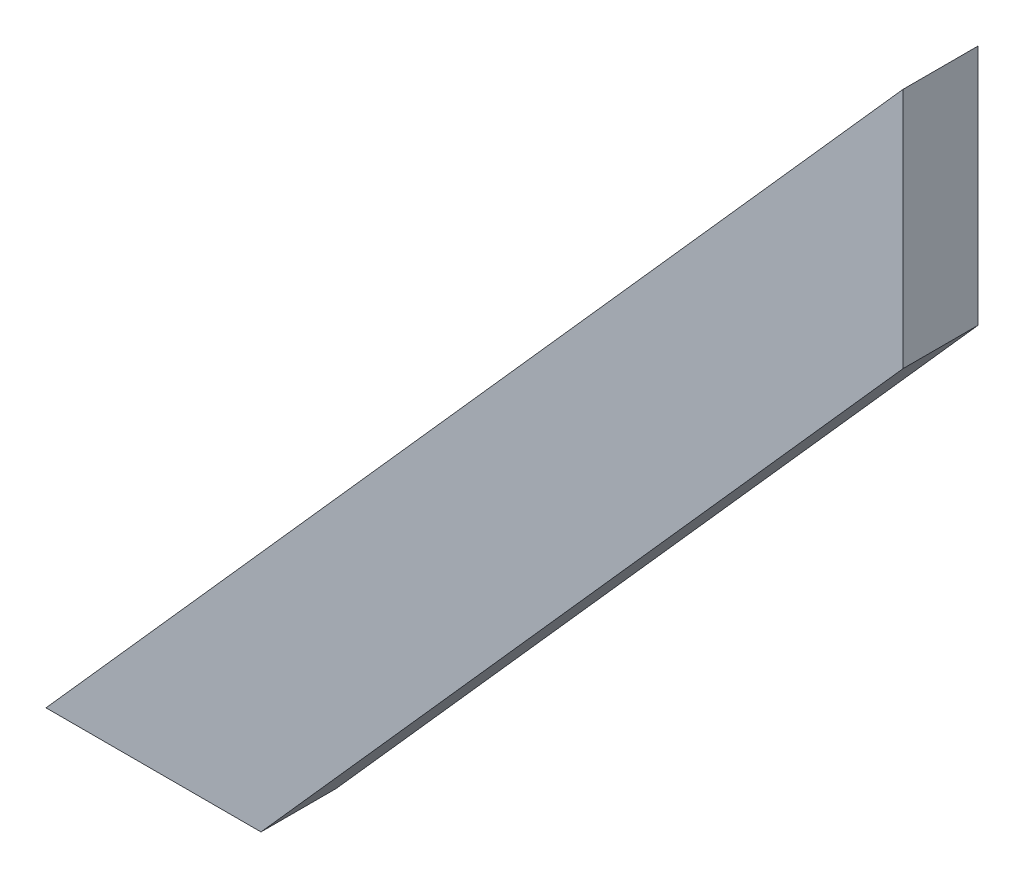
ISO-10303-21;
HEADER;
FILE_DESCRIPTION(('STEP AP214'),'2;1');
FILE_NAME('part.step','',(''),(''),'','','');
FILE_SCHEMA(('AUTOMOTIVE_DESIGN { 1 0 10303 214 1 1 1 1 }'));
ENDSEC;
DATA;
#1=APPLICATION_CONTEXT('core data for automotive mechanical design processes');
#2=APPLICATION_PROTOCOL_DEFINITION('international standard','automotive_design',2000,#1);
#3=PRODUCT_CONTEXT('',#1,'mechanical');
#4=PRODUCT('Part','Part','',(#3));
#5=PRODUCT_RELATED_PRODUCT_CATEGORY('part','',(#4));
#6=PRODUCT_DEFINITION_FORMATION('','',#4);
#7=PRODUCT_DEFINITION_CONTEXT('part definition',#1,'design');
#8=PRODUCT_DEFINITION('design','',#6,#7);
#9=PRODUCT_DEFINITION_SHAPE('','',#8);
#10=(LENGTH_UNIT() NAMED_UNIT(*) SI_UNIT(.MILLI.,.METRE.));
#11=(NAMED_UNIT(*) PLANE_ANGLE_UNIT() SI_UNIT($,.RADIAN.));
#12=(NAMED_UNIT(*) SI_UNIT($,.STERADIAN.) SOLID_ANGLE_UNIT());
#13=UNCERTAINTY_MEASURE_WITH_UNIT(LENGTH_MEASURE(1.E-05),#10,'distance_accuracy_value','');
#14=(GEOMETRIC_REPRESENTATION_CONTEXT(3) GLOBAL_UNCERTAINTY_ASSIGNED_CONTEXT((#13)) GLOBAL_UNIT_ASSIGNED_CONTEXT((#10,
#11,#12)) REPRESENTATION_CONTEXT('',''));
#15=CARTESIAN_POINT('',(0.,0.,0.));
#16=DIRECTION('',(0.,0.,1.));
#17=DIRECTION('',(1.,0.,0.));
#18=AXIS2_PLACEMENT_3D('',#15,#16,#17);
#19=CARTESIAN_POINT('',(14.0228045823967,367.823830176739,12.7));
#20=DIRECTION('',(0.,0.,1.));
#21=DIRECTION('',(1.,0.,0.));
#22=AXIS2_PLACEMENT_3D('',#19,#20,#21);
#23=PLANE('',#22);
#24=CARTESIAN_POINT('',(14.0228045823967,367.823830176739,12.7));
#25=DIRECTION('',(0.,0.,-1.));
#26=DIRECTION('',(-1.,0.,0.));
#27=AXIS2_PLACEMENT_3D('',#24,#25,#26);
#28=CIRCLE('',#27,1.27000000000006);
#29=CARTESIAN_POINT('',(12.7528045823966,367.823830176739,12.7));
#30=VERTEX_POINT('',#29);
#31=EDGE_CURVE('E19',#30,#30,#28,.T.);
#32=ORIENTED_EDGE('',*,*,#31,.T.);
#33=EDGE_LOOP('',(#32));
#34=FACE_BOUND('',#33,.T.);
#35=ADVANCED_FACE('F16',(#34),#23,.F.);
#36=CARTESIAN_POINT('',(93.3647269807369,457.083492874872,12.7));
#37=DIRECTION('',(0.,0.,1.));
#38=DIRECTION('',(1.,0.,0.));
#39=AXIS2_PLACEMENT_3D('',#36,#37,#38);
#40=PLANE('',#39);
#41=CARTESIAN_POINT('',(93.3647269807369,457.083492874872,12.7));
#42=DIRECTION('',(0.,0.,-1.));
#43=DIRECTION('',(-1.,0.,0.));
#44=AXIS2_PLACEMENT_3D('',#41,#42,#43);
#45=CIRCLE('',#44,1.27000000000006);
#46=CARTESIAN_POINT('',(92.0947269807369,457.083492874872,12.7));
#47=VERTEX_POINT('',#46);
#48=EDGE_CURVE('E92',#47,#47,#45,.T.);
#49=ORIENTED_EDGE('',*,*,#48,.T.);
#50=EDGE_LOOP('',(#49));
#51=FACE_BOUND('',#50,.T.);
#52=ADVANCED_FACE('F114',(#51),#40,.F.);
#53=CARTESIAN_POINT('',(162.180159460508,534.500854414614,12.7));
#54=DIRECTION('',(0.,0.,1.));
#55=DIRECTION('',(1.,0.,0.));
#56=AXIS2_PLACEMENT_3D('',#53,#54,#55);
#57=PLANE('',#56);
#58=CARTESIAN_POINT('',(162.180159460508,534.500854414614,12.7));
#59=DIRECTION('',(0.,0.,-1.));
#60=DIRECTION('',(-1.,0.,0.));
#61=AXIS2_PLACEMENT_3D('',#58,#59,#60);
#62=CIRCLE('',#61,1.27000000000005);
#63=CARTESIAN_POINT('',(160.910159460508,534.500854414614,12.7));
#64=VERTEX_POINT('',#63);
#65=EDGE_CURVE('E90',#64,#64,#62,.T.);
#66=ORIENTED_EDGE('',*,*,#65,.T.);
#67=EDGE_LOOP('',(#66));
#68=FACE_BOUND('',#67,.T.);
#69=ADVANCED_FACE('F103',(#68),#57,.F.);
#70=CARTESIAN_POINT('',(14.0228045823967,367.823830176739,12.7));
#71=DIRECTION('',(0.,0.,-1.));
#72=DIRECTION('',(-1.,0.,0.));
#73=AXIS2_PLACEMENT_3D('',#70,#71,#72);
#74=CYLINDRICAL_SURFACE('',#73,1.27000000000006);
#75=CARTESIAN_POINT('',(14.0228045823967,367.823830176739,6.096));
#76=DIRECTION('',(0.,0.,-1.));
#77=DIRECTION('',(-1.,0.,0.));
#78=AXIS2_PLACEMENT_3D('',#75,#76,#77);
#79=CIRCLE('',#78,1.27000000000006);
#80=CARTESIAN_POINT('',(12.7528045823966,367.823830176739,6.096));
#81=VERTEX_POINT('',#80);
#82=EDGE_CURVE('E87',#81,#81,#79,.T.);
#83=ORIENTED_EDGE('',*,*,#82,.T.);
#84=EDGE_LOOP('',(#83));
#85=FACE_BOUND('',#84,.T.);
#86=ORIENTED_EDGE('',*,*,#31,.F.);
#87=EDGE_LOOP('',(#86));
#88=FACE_BOUND('',#87,.T.);
#89=ADVANCED_FACE('F100',(#85,#88),#74,.F.);
#90=CARTESIAN_POINT('',(93.3647269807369,457.083492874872,12.7));
#91=DIRECTION('',(0.,0.,-1.));
#92=DIRECTION('',(-1.,0.,0.));
#93=AXIS2_PLACEMENT_3D('',#90,#91,#92);
#94=CYLINDRICAL_SURFACE('',#93,1.27000000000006);
#95=CARTESIAN_POINT('',(93.3647269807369,457.083492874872,6.096));
#96=DIRECTION('',(0.,0.,-1.));
#97=DIRECTION('',(-1.,0.,0.));
#98=AXIS2_PLACEMENT_3D('',#95,#96,#97);
#99=CIRCLE('',#98,1.27000000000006);
#100=CARTESIAN_POINT('',(92.0947269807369,457.083492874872,6.096));
#101=VERTEX_POINT('',#100);
#102=EDGE_CURVE('E84',#101,#101,#99,.T.);
#103=ORIENTED_EDGE('',*,*,#102,.T.);
#104=EDGE_LOOP('',(#103));
#105=FACE_BOUND('',#104,.T.);
#106=ORIENTED_EDGE('',*,*,#48,.F.);
#107=EDGE_LOOP('',(#106));
#108=FACE_BOUND('',#107,.T.);
#109=ADVANCED_FACE('F102',(#105,#108),#94,.F.);
#110=CARTESIAN_POINT('',(162.180159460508,534.500854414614,12.7));
#111=DIRECTION('',(0.,0.,-1.));
#112=DIRECTION('',(-1.,0.,0.));
#113=AXIS2_PLACEMENT_3D('',#110,#111,#112);
#114=CYLINDRICAL_SURFACE('',#113,1.27000000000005);
#115=CARTESIAN_POINT('',(162.180159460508,534.500854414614,6.096));
#116=DIRECTION('',(0.,0.,-1.));
#117=DIRECTION('',(-1.,0.,0.));
#118=AXIS2_PLACEMENT_3D('',#115,#116,#117);
#119=CIRCLE('',#118,1.27000000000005);
#120=CARTESIAN_POINT('',(160.910159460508,534.500854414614,6.096));
#121=VERTEX_POINT('',#120);
#122=EDGE_CURVE('E67',#121,#121,#119,.T.);
#123=ORIENTED_EDGE('',*,*,#122,.T.);
#124=EDGE_LOOP('',(#123));
#125=FACE_BOUND('',#124,.T.);
#126=ORIENTED_EDGE('',*,*,#65,.F.);
#127=EDGE_LOOP('',(#126));
#128=FACE_BOUND('',#127,.T.);
#129=ADVANCED_FACE('F111',(#125,#128),#114,.F.);
#130=CARTESIAN_POINT('',(0.,0.,6.096));
#131=DIRECTION('',(0.,0.,1.));
#132=DIRECTION('',(1.,0.,0.));
#133=AXIS2_PLACEMENT_3D('',#130,#131,#132);
#134=PLANE('',#133);
#135=DIRECTION('',(0.664363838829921,0.747409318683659,0.));
#136=VECTOR('',#135,1.);
#137=CARTESIAN_POINT('',(-186.200646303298,165.511685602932,6.096));
#138=LINE('',#137,#136);
#139=CARTESIAN_POINT('',(-19.7646228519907,352.752211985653,6.096));
#140=VERTEX_POINT('',#139);
#141=CARTESIAN_POINT('',(183.43537714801,581.352211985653,6.096));
#142=VERTEX_POINT('',#141);
#143=EDGE_CURVE('E203',#140,#142,#138,.T.);
#144=ORIENTED_EDGE('',*,*,#143,.T.);
#145=DIRECTION('',(0.,1.,0.));
#146=VECTOR('',#145,1.);
#147=CARTESIAN_POINT('',(183.435377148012,7.10238699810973E-13,6.096));
#148=LINE('',#147,#146);
#149=CARTESIAN_POINT('',(183.43537714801,524.004117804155,6.096));
#150=VERTEX_POINT('',#149);
#151=EDGE_CURVE('E54',#150,#142,#148,.T.);
#152=ORIENTED_EDGE('',*,*,#151,.F.);
#153=DIRECTION('',(-0.66436383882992,-0.747409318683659,0.));
#154=VECTOR('',#153,1.);
#155=CARTESIAN_POINT('',(-157.724351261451,140.199423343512,6.096));
#156=LINE('',#155,#154);
#157=CARTESIAN_POINT('',(31.2114608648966,352.752211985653,6.096));
#158=VERTEX_POINT('',#157);
#159=EDGE_CURVE('E69',#150,#158,#156,.T.);
#160=ORIENTED_EDGE('',*,*,#159,.T.);
#161=DIRECTION('',(1.,0.,0.));
#162=VECTOR('',#161,1.);
#163=CARTESIAN_POINT('',(0.,352.752211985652,6.096));
#164=LINE('',#163,#162);
#165=EDGE_CURVE('E59',#158,#140,#164,.F.);
#166=ORIENTED_EDGE('',*,*,#165,.T.);
#167=EDGE_LOOP('',(#144,#152,#160,#166));
#168=FACE_BOUND('',#167,.T.);
#169=ORIENTED_EDGE('',*,*,#122,.F.);
#170=EDGE_LOOP('',(#169));
#171=FACE_BOUND('',#170,.T.);
#172=ORIENTED_EDGE('',*,*,#102,.F.);
#173=EDGE_LOOP('',(#172));
#174=FACE_BOUND('',#173,.T.);
#175=ORIENTED_EDGE('',*,*,#82,.F.);
#176=EDGE_LOOP('',(#175));
#177=FACE_BOUND('',#176,.T.);
#178=ADVANCED_FACE('F70',(#168,#171,#174,#177),#134,.F.);
#179=CARTESIAN_POINT('',(0.,352.752211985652,23.876));
#180=DIRECTION('',(0.,1.,0.));
#181=DIRECTION('',(0.,0.,1.));
#182=AXIS2_PLACEMENT_3D('',#179,#180,#181);
#183=PLANE('',#182);
#184=DIRECTION('',(0.,0.,1.));
#185=VECTOR('',#184,1.);
#186=CARTESIAN_POINT('',(31.2114608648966,352.752211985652,23.876));
#187=LINE('',#186,#185);
#188=CARTESIAN_POINT('',(31.2114608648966,352.752211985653,23.876));
#189=VERTEX_POINT('',#188);
#190=EDGE_CURVE('E62',#158,#189,#187,.T.);
#191=ORIENTED_EDGE('',*,*,#190,.T.);
#192=DIRECTION('',(1.,0.,0.));
#193=VECTOR('',#192,1.);
#194=CARTESIAN_POINT('',(0.,352.752211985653,23.876));
#195=LINE('',#194,#193);
#196=CARTESIAN_POINT('',(-19.7646228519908,352.752211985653,23.876));
#197=VERTEX_POINT('',#196);
#198=EDGE_CURVE('E201',#197,#189,#195,.T.);
#199=ORIENTED_EDGE('',*,*,#198,.F.);
#200=DIRECTION('',(0.,0.,1.));
#201=VECTOR('',#200,1.);
#202=CARTESIAN_POINT('',(-19.7646228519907,352.752211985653,23.876));
#203=LINE('',#202,#201);
#204=EDGE_CURVE('E65',#197,#140,#203,.F.);
#205=ORIENTED_EDGE('',*,*,#204,.T.);
#206=ORIENTED_EDGE('',*,*,#165,.F.);
#207=EDGE_LOOP('',(#191,#199,#205,#206));
#208=FACE_BOUND('',#207,.T.);
#209=ADVANCED_FACE('F60',(#208),#183,.F.);
#210=CARTESIAN_POINT('',(-157.724351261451,140.199423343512,23.876));
#211=DIRECTION('',(-0.747409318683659,0.66436383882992,0.));
#212=DIRECTION('',(-0.66436383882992,-0.747409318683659,0.));
#213=AXIS2_PLACEMENT_3D('',#210,#211,#212);
#214=PLANE('',#213);
#215=DIRECTION('',(0.,0.,1.));
#216=VECTOR('',#215,1.);
#217=CARTESIAN_POINT('',(183.43537714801,524.004117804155,23.876));
#218=LINE('',#217,#216);
#219=CARTESIAN_POINT('',(183.43537714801,524.004117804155,23.876));
#220=VERTEX_POINT('',#219);
#221=EDGE_CURVE('E199',#220,#150,#218,.F.);
#222=ORIENTED_EDGE('',*,*,#221,.F.);
#223=DIRECTION('',(0.66436383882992,0.747409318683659,0.));
#224=VECTOR('',#223,1.);
#225=CARTESIAN_POINT('',(31.2114608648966,352.752211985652,23.876));
#226=LINE('',#225,#224);
#227=EDGE_CURVE('E77',#189,#220,#226,.T.);
#228=ORIENTED_EDGE('',*,*,#227,.F.);
#229=ORIENTED_EDGE('',*,*,#190,.F.);
#230=ORIENTED_EDGE('',*,*,#159,.F.);
#231=EDGE_LOOP('',(#222,#228,#229,#230));
#232=FACE_BOUND('',#231,.T.);
#233=ADVANCED_FACE('F75',(#232),#214,.F.);
#234=CARTESIAN_POINT('',(183.435377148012,7.10238699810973E-13,23.876));
#235=DIRECTION('',(1.,0.,0.));
#236=DIRECTION('',(0.,1.,0.));
#237=AXIS2_PLACEMENT_3D('',#234,#235,#236);
#238=PLANE('',#237);
#239=DIRECTION('',(0.,1.,0.));
#240=VECTOR('',#239,1.);
#241=CARTESIAN_POINT('',(183.43537714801,0.,23.876));
#242=LINE('',#241,#240);
#243=CARTESIAN_POINT('',(183.43537714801,581.352211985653,23.876));
#244=VERTEX_POINT('',#243);
#245=EDGE_CURVE('E25',#220,#244,#242,.T.);
#246=ORIENTED_EDGE('',*,*,#245,.F.);
#247=ORIENTED_EDGE('',*,*,#221,.T.);
#248=ORIENTED_EDGE('',*,*,#151,.T.);
#249=DIRECTION('',(0.,0.,1.));
#250=VECTOR('',#249,1.);
#251=CARTESIAN_POINT('',(183.43537714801,581.352211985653,23.876));
#252=LINE('',#251,#250);
#253=EDGE_CURVE('E34',#142,#244,#252,.T.);
#254=ORIENTED_EDGE('',*,*,#253,.T.);
#255=EDGE_LOOP('',(#246,#247,#248,#254));
#256=FACE_BOUND('',#255,.T.);
#257=ADVANCED_FACE('F125',(#256),#238,.T.);
#258=CARTESIAN_POINT('',(-186.200646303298,165.511685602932,23.876));
#259=DIRECTION('',(0.747409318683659,-0.664363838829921,0.));
#260=DIRECTION('',(0.664363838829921,0.747409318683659,0.));
#261=AXIS2_PLACEMENT_3D('',#258,#259,#260);
#262=PLANE('',#261);
#263=ORIENTED_EDGE('',*,*,#204,.F.);
#264=DIRECTION('',(-0.664363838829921,-0.747409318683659,0.));
#265=VECTOR('',#264,1.);
#266=CARTESIAN_POINT('',(183.43537714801,581.352211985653,23.876));
#267=LINE('',#266,#265);
#268=EDGE_CURVE('E10',#244,#197,#267,.T.);
#269=ORIENTED_EDGE('',*,*,#268,.F.);
#270=ORIENTED_EDGE('',*,*,#253,.F.);
#271=ORIENTED_EDGE('',*,*,#143,.F.);
#272=EDGE_LOOP('',(#263,#269,#270,#271));
#273=FACE_BOUND('',#272,.T.);
#274=ADVANCED_FACE('F119',(#273),#262,.F.);
#275=CARTESIAN_POINT('',(0.,0.,23.876));
#276=DIRECTION('',(0.,0.,1.));
#277=DIRECTION('',(1.,0.,0.));
#278=AXIS2_PLACEMENT_3D('',#275,#276,#277);
#279=PLANE('',#278);
#280=ORIENTED_EDGE('',*,*,#245,.T.);
#281=ORIENTED_EDGE('',*,*,#268,.T.);
#282=ORIENTED_EDGE('',*,*,#198,.T.);
#283=ORIENTED_EDGE('',*,*,#227,.T.);
#284=EDGE_LOOP('',(#280,#281,#282,#283));
#285=FACE_BOUND('',#284,.T.);
#286=ADVANCED_FACE('F117',(#285),#279,.T.);
#287=CLOSED_SHELL('',(#35,#52,#69,#89,#109,#129,#178,#209,#233,#257,#274,#286));
#288=MANIFOLD_SOLID_BREP('B1',#287);
#289=ADVANCED_BREP_SHAPE_REPRESENTATION('',(#18,#288),#14);
#290=SHAPE_DEFINITION_REPRESENTATION(#9,#289);
ENDSEC;
END-ISO-10303-21;
